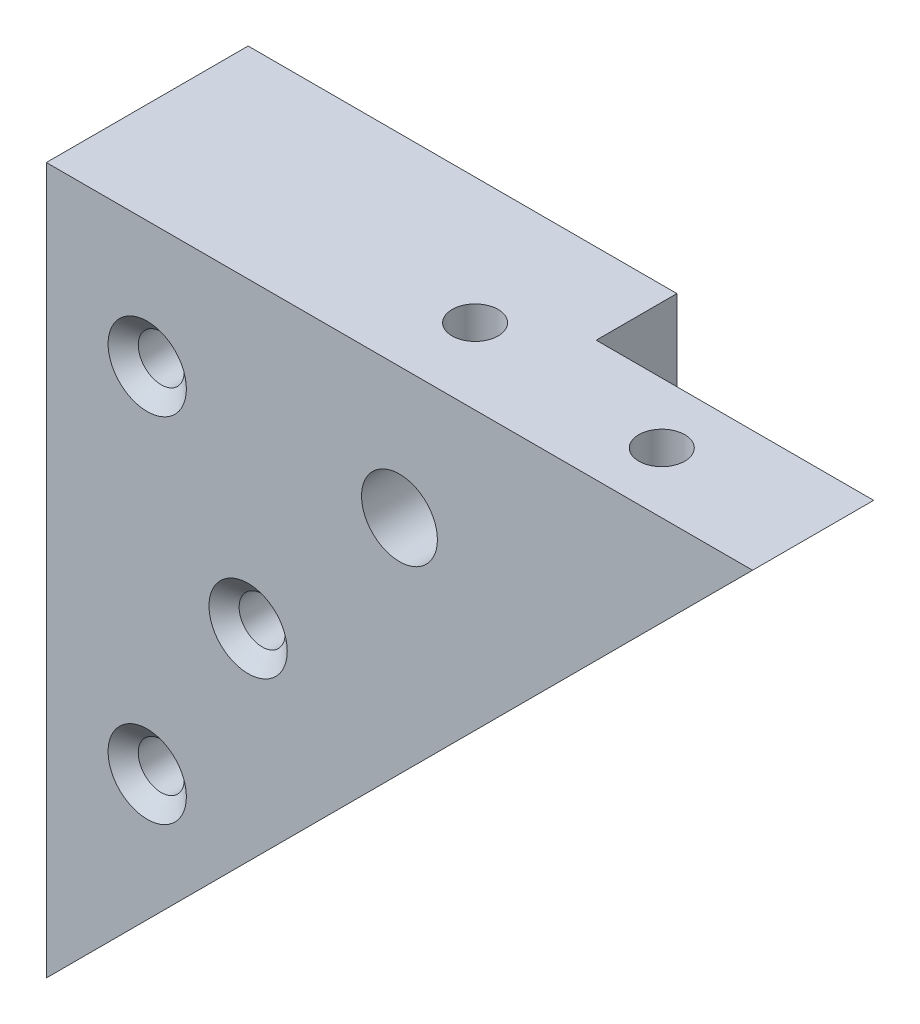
from build123d import *

# Parameters (mm, degrees)
EXTRUDE1_DEPTH     = 25.4
SKETCH3_W          = 34.925
SKETCH3_H          = 10.16
CUT_EXTRUDE1_DEPTH = 129.263712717
SKETCH4_R          = 4.7752
CUT_EXTRUDE2_DEPTH = 129.263712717
SKETCH5_R          = 2.8956
CUT_EXTRUDE3_DEPTH = 129.263712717
CUT_EXTRUDE4_START = -12.7
SKETCH6_R          = 6.6294
CUT_EXTRUDE4_DEPTH = 19.05
SKETCH7_R          = 2.8956
CUT_EXTRUDE5_DEPTH = 129.263712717
CHAMFER1_SIZE      = 2.032
CHAMFER1_SIZE2     = 1.766390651
SKETCH9_R          = 2.8956
CUT_EXTRUDE7_DEPTH = 25.4


with BuildPart() as part:
    # Sketch2 → Extrude1 (new body)
    with BuildSketch(Plane.XY):
        Polygon((0, 88.9), (0, 0), (88.9, 88.9), align=None)
    extrude(amount=EXTRUDE1_DEPTH)

    # Sketch3 → Cut-Extrude1 (cut, through all)
    with BuildSketch(Plane(origin=(0, 88.9, 0), x_dir=(-1, 0, 0), z_dir=(0, 1, 0))):
        with Locations((-71.4375, 5.08)):
            Rectangle(SKETCH3_W, SKETCH3_H)
    extrude(amount=-CUT_EXTRUDE1_DEPTH, mode=Mode.SUBTRACT)

    # Sketch4 → Cut-Extrude2 (cut, through all)
    with BuildSketch(Plane.XY.offset(25.4)):
        with Locations((44.45, 72.39)):
            Circle(SKETCH4_R)
    extrude(amount=-CUT_EXTRUDE2_DEPTH, mode=Mode.SUBTRACT)

    # Sketch5 → Cut-Extrude3 (cut, through all)
    with BuildSketch(Plane(origin=(0, 88.9, 0), x_dir=(-1, 0, 0), z_dir=(0, 1, 0))):
        with Locations((-69.85, 17.78)):
            Circle(SKETCH5_R)
    extrude(amount=-CUT_EXTRUDE3_DEPTH, mode=Mode.SUBTRACT)

    # Sketch6 → Cut-Extrude4 (cut)
    with BuildSketch(Plane(origin=(0, 88.9, 0), x_dir=(-1, 0, 0), z_dir=(0, 1, 0)).offset(CUT_EXTRUDE4_START)):
        with Locations((-69.85, 17.78)):
            Circle(SKETCH6_R)
    extrude(amount=-CUT_EXTRUDE4_DEPTH, mode=Mode.SUBTRACT)

    # Sketch7 → Cut-Extrude5 (cut, through all)
    with BuildSketch(Plane.XY.offset(25.4)):
        with Locations((12.7, 73.025)):
            Circle(SKETCH7_R)
        with Locations((12.7, 28.575)):
            Circle(SKETCH7_R)
        with Locations((25.4, 50.8)):
            Circle(SKETCH7_R)
    extrude(amount=-CUT_EXTRUDE5_DEPTH, mode=Mode.SUBTRACT)

    # Chamfer1
    chamfer1_edges = [part.edges().sort_by_distance(p)[0] for p in [
        (9.8044, 73.025, 25.4),
        (9.8044, 28.575, 25.4),
        (22.5044, 50.8, 25.4),
    ]]
    chamfer1_side = [part.faces().sort_by_distance(p)[0] for p in [
        (29.618118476, 59.195354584, 25.4),
    ]]
    chamfer(chamfer1_edges, length=CHAMFER1_SIZE, length2=CHAMFER1_SIZE2, reference=chamfer1_side[0])

    # Sketch9 → Cut-Extrude7 (cut)
    with BuildSketch(Plane(origin=(0, 88.9, 0), x_dir=(-1, 0, 0), z_dir=(0, 1, 0))):
        with Locations((-44.45, 15.875)):
            Circle(SKETCH9_R)
    extrude(amount=-CUT_EXTRUDE7_DEPTH, mode=Mode.SUBTRACT)


solid = part.part
